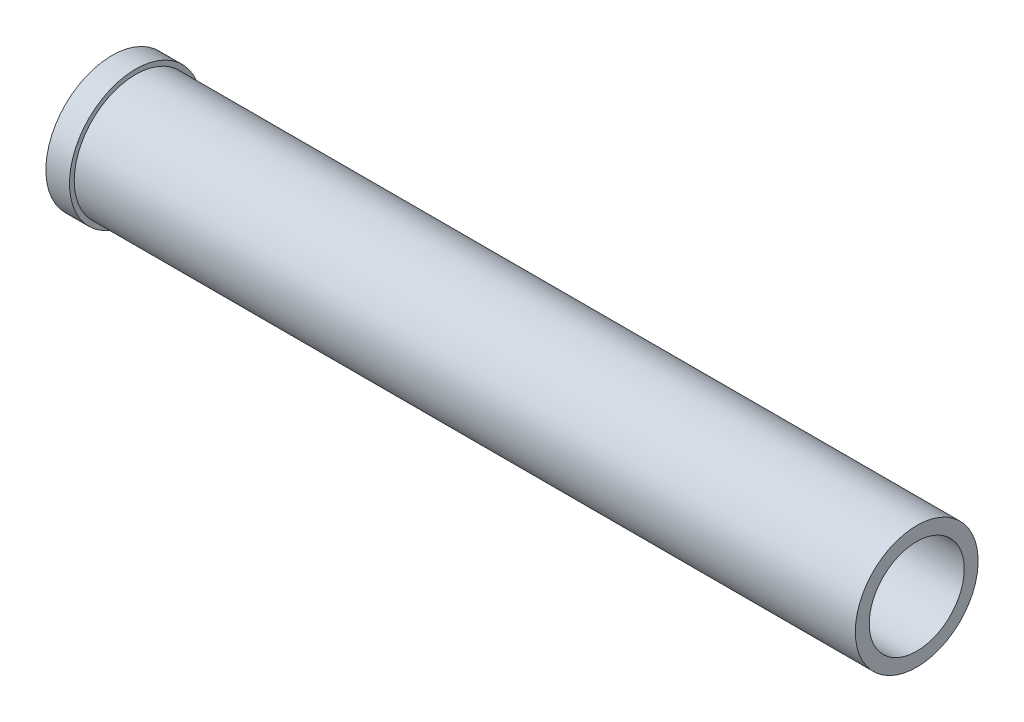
from build123d import *

# Parameters (mm, degrees)
ESQUISSE1_R             = 70
EXTRUSION1_DEPTH        = 25
ESQUISSE2_R             = 65
EXTRUSION2_DEPTH        = 852
ESQUISSE3_R             = 64
ENL_V_MAT_EXTRU_1_DEPTH = 730
ESQUISSE4_R             = 50.3
ENL_V_MAT_EXTRU_2_DEPTH = 858.731892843


with BuildPart() as part:
    # Esquisse1 → Extrusion1 (new body)
    with BuildSketch(Plane(origin=(0, 0, 0), x_dir=(0, 0, -1), z_dir=(1, 0, 0))):
        Circle(ESQUISSE1_R)
    extrude(amount=EXTRUSION1_DEPTH)

    # Esquisse2 → Extrusion2 (add)
    with BuildSketch(Plane.ZY):
        Circle(ESQUISSE2_R)
    extrude(amount=-EXTRUSION2_DEPTH)

    # Esquisse3 → Enl_v. mat.-Extru.1 (cut)
    with BuildSketch(Plane.ZY):
        Circle(ESQUISSE3_R)
    extrude(amount=-ENL_V_MAT_EXTRU_1_DEPTH, mode=Mode.SUBTRACT)

    # Esquisse4 → Enl_v. mat.-Extru.2 (cut, through all)
    with BuildSketch(Plane(origin=(852, 0, 0), x_dir=(0, 0, -1), z_dir=(1, 0, 0))):
        Circle(ESQUISSE4_R)
    extrude(amount=-ENL_V_MAT_EXTRU_2_DEPTH, mode=Mode.SUBTRACT)


solid = part.part
